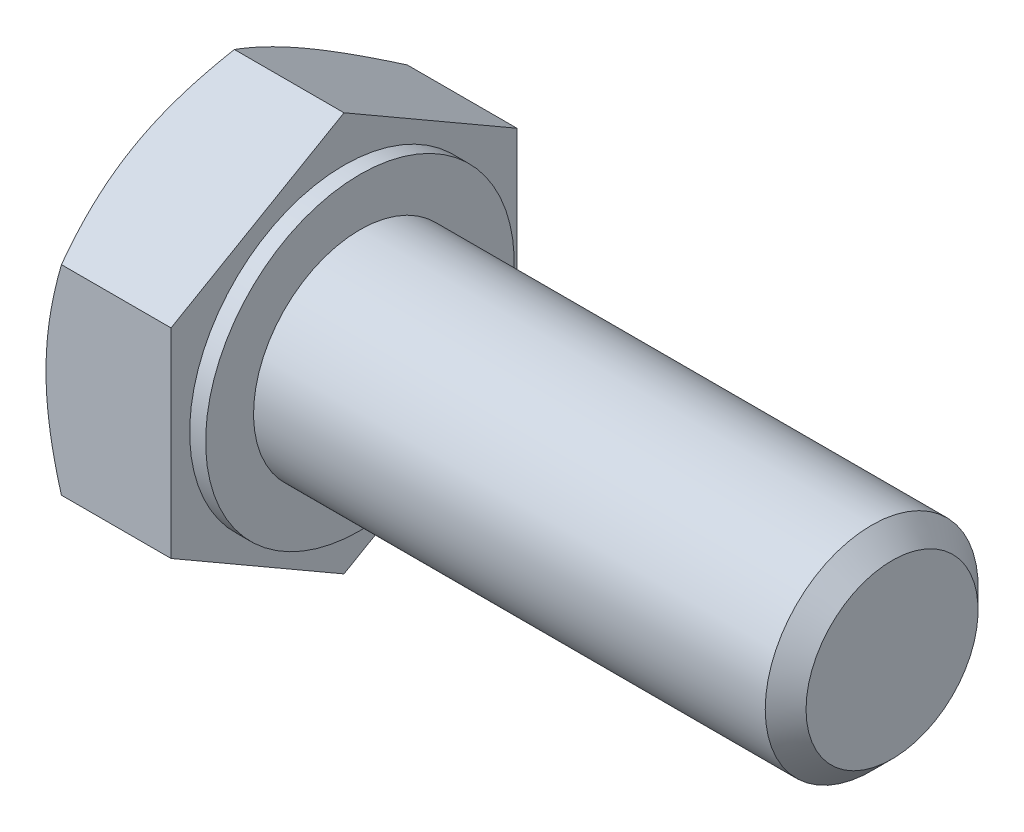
ISO-10303-21;
HEADER;
FILE_DESCRIPTION(('STEP AP214'),'2;1');
FILE_NAME('part.step','',(''),(''),'','','');
FILE_SCHEMA(('AUTOMOTIVE_DESIGN { 1 0 10303 214 1 1 1 1 }'));
ENDSEC;
DATA;
#1=APPLICATION_CONTEXT('core data for automotive mechanical design processes');
#2=APPLICATION_PROTOCOL_DEFINITION('international standard','automotive_design',2000,#1);
#3=PRODUCT_CONTEXT('',#1,'mechanical');
#4=PRODUCT('Part','Part','',(#3));
#5=PRODUCT_RELATED_PRODUCT_CATEGORY('part','',(#4));
#6=PRODUCT_DEFINITION_FORMATION('','',#4);
#7=PRODUCT_DEFINITION_CONTEXT('part definition',#1,'design');
#8=PRODUCT_DEFINITION('design','',#6,#7);
#9=PRODUCT_DEFINITION_SHAPE('','',#8);
#10=(LENGTH_UNIT() NAMED_UNIT(*) SI_UNIT(.MILLI.,.METRE.));
#11=(NAMED_UNIT(*) PLANE_ANGLE_UNIT() SI_UNIT($,.RADIAN.));
#12=(NAMED_UNIT(*) SI_UNIT($,.STERADIAN.) SOLID_ANGLE_UNIT());
#13=UNCERTAINTY_MEASURE_WITH_UNIT(LENGTH_MEASURE(1.E-05),#10,'distance_accuracy_value','');
#14=(GEOMETRIC_REPRESENTATION_CONTEXT(3) GLOBAL_UNCERTAINTY_ASSIGNED_CONTEXT((#13)) GLOBAL_UNIT_ASSIGNED_CONTEXT((#10,
#11,#12)) REPRESENTATION_CONTEXT('',''));
#15=CARTESIAN_POINT('',(0.,0.,0.));
#16=DIRECTION('',(0.,0.,1.));
#17=DIRECTION('',(1.,0.,0.));
#18=AXIS2_PLACEMENT_3D('',#15,#16,#17);
#19=CARTESIAN_POINT('',(-5.30009999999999,0.,0.));
#20=DIRECTION('',(1.,0.,0.));
#21=DIRECTION('',(0.,0.,-1.));
#22=AXIS2_PLACEMENT_3D('',#19,#20,#21);
#23=PLANE('',#22);
#24=CARTESIAN_POINT('',(-5.30010000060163,0.,0.));
#25=DIRECTION('',(1.,0.,0.));
#26=DIRECTION('',(0.,0.,-1.));
#27=AXIS2_PLACEMENT_3D('',#24,#25,#26);
#28=CIRCLE('',#27,6.50000000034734);
#29=CARTESIAN_POINT('',(-5.3001000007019,5.62916512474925,-3.25000000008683));
#30=VERTEX_POINT('',#29);
#31=CARTESIAN_POINT('',(-5.3001000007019,5.62916512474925,3.25000000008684));
#32=VERTEX_POINT('',#31);
#33=EDGE_CURVE('E347',#30,#32,#28,.T.);
#34=ORIENTED_EDGE('',*,*,#33,.F.);
#35=CARTESIAN_POINT('',(-5.30010000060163,0.,0.));
#36=DIRECTION('',(1.,0.,0.));
#37=DIRECTION('',(0.,0.,-1.));
#38=AXIS2_PLACEMENT_3D('',#35,#36,#37);
#39=CIRCLE('',#38,6.50000000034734);
#40=CARTESIAN_POINT('',(-5.3001000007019,0.,-6.50000000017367));
#41=VERTEX_POINT('',#40);
#42=EDGE_CURVE('E343',#41,#30,#39,.T.);
#43=ORIENTED_EDGE('',*,*,#42,.F.);
#44=CARTESIAN_POINT('',(-5.30010000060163,0.,0.));
#45=DIRECTION('',(1.,0.,0.));
#46=DIRECTION('',(0.,0.,-1.));
#47=AXIS2_PLACEMENT_3D('',#44,#45,#46);
#48=CIRCLE('',#47,6.50000000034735);
#49=CARTESIAN_POINT('',(-5.3001000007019,-5.62916512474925,-3.25000000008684));
#50=VERTEX_POINT('',#49);
#51=EDGE_CURVE('E339',#50,#41,#48,.T.);
#52=ORIENTED_EDGE('',*,*,#51,.F.);
#53=CARTESIAN_POINT('',(-5.30010000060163,0.,0.));
#54=DIRECTION('',(1.,0.,0.));
#55=DIRECTION('',(0.,0.,-1.));
#56=AXIS2_PLACEMENT_3D('',#53,#54,#55);
#57=CIRCLE('',#56,6.50000000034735);
#58=CARTESIAN_POINT('',(-5.3001000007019,-5.62916512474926,3.25000000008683));
#59=VERTEX_POINT('',#58);
#60=EDGE_CURVE('E90',#59,#50,#57,.T.);
#61=ORIENTED_EDGE('',*,*,#60,.F.);
#62=CARTESIAN_POINT('',(-5.30010000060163,0.,0.));
#63=DIRECTION('',(1.,0.,0.));
#64=DIRECTION('',(0.,0.,-1.));
#65=AXIS2_PLACEMENT_3D('',#62,#63,#64);
#66=CIRCLE('',#65,6.50000000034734);
#67=CARTESIAN_POINT('',(-5.3001000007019,0.,6.50000000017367));
#68=VERTEX_POINT('',#67);
#69=EDGE_CURVE('E87',#68,#59,#66,.T.);
#70=ORIENTED_EDGE('',*,*,#69,.F.);
#71=CARTESIAN_POINT('',(-5.30010000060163,0.,0.));
#72=DIRECTION('',(1.,0.,0.));
#73=DIRECTION('',(0.,0.,-1.));
#74=AXIS2_PLACEMENT_3D('',#71,#72,#73);
#75=CIRCLE('',#74,6.50000000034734);
#76=EDGE_CURVE('E19',#32,#68,#75,.T.);
#77=ORIENTED_EDGE('',*,*,#76,.F.);
#78=EDGE_LOOP('',(#34,#43,#52,#61,#70,#77));
#79=FACE_BOUND('',#78,.T.);
#80=ADVANCED_FACE('F16',(#79),#23,.F.);
#81=CARTESIAN_POINT('',(-4.71606007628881,0.,0.));
#82=DIRECTION('',(1.,0.,0.));
#83=DIRECTION('',(0.,0.,-1.));
#84=AXIS2_PLACEMENT_3D('',#81,#82,#83);
#85=CONICAL_SURFACE('',#84,7.51158682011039,1.04719755);
#86=ORIENTED_EDGE('',*,*,#76,.T.);
#87=CARTESIAN_POINT('',(-4.71954341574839,3.75277674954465,6.50000000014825));
#88=CARTESIAN_POINT('',(-4.80774841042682,3.44730232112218,6.50000000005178));
#89=CARTESIAN_POINT('',(-4.88855958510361,3.13938154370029,6.50000000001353));
#90=CARTESIAN_POINT('',(-5.03106863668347,2.52082569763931,6.49999999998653));
#91=CARTESIAN_POINT('',(-5.09286102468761,2.2102122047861,6.49999999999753));
#92=CARTESIAN_POINT('',(-5.16873158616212,1.74136052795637,6.50000000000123));
#93=CARTESIAN_POINT('',(-5.19122798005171,1.58448437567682,6.50000000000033));
#94=CARTESIAN_POINT('',(-5.23016970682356,1.26998104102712,6.49999999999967));
#95=CARTESIAN_POINT('',(-5.24661519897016,1.11235387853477,6.4999999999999));
#96=CARTESIAN_POINT('',(-5.27316617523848,0.795765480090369,6.50000000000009));
#97=CARTESIAN_POINT('',(-5.28323941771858,0.636801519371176,6.50000000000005));
#98=CARTESIAN_POINT('',(-5.29672027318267,0.31856096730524,6.49999999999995));
#99=CARTESIAN_POINT('',(-5.30012656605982,0.159284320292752,6.4999999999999));
#100=CARTESIAN_POINT('',(-5.30010000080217,1.44683826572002E-11,6.5));
#101=B_SPLINE_CURVE_WITH_KNOTS('',3,(#87,#88,#89,#90,#91,#92,#93,#94,#95,#96,#97,#98,#99,#100),
.UNSPECIFIED.,.F.,.F.,(4,2,2,2,2,2,4),(0.,0.95424765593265,1.90367376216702,2.37900973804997,
2.85433320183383,3.33204281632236,3.80984701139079),.UNSPECIFIED.);
#102=CARTESIAN_POINT('',(-4.71954341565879,3.75277674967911,6.49999999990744));
#103=VERTEX_POINT('',#102);
#104=EDGE_CURVE('E108',#103,#68,#101,.T.);
#105=ORIENTED_EDGE('',*,*,#104,.F.);
#106=CARTESIAN_POINT('',(-5.30010000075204,5.62916512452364,3.24999999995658));
#107=CARTESIAN_POINT('',(-5.30012656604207,5.54952296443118,3.38794426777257));
#108=CARTESIAN_POINT('',(-5.29672027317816,5.4698846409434,3.52588189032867));
#109=CARTESIAN_POINT('',(-5.28323941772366,5.31076436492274,3.80148629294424));
#110=CARTESIAN_POINT('',(-5.27316617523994,5.231282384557,3.93915312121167));
#111=CARTESIAN_POINT('',(-5.24661519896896,5.07298818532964,4.21332671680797));
#112=CARTESIAN_POINT('',(-5.23016970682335,4.99417460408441,4.34983584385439));
#113=CARTESIAN_POINT('',(-5.19122798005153,4.8369229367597,4.62220372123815));
#114=CARTESIAN_POINT('',(-5.16873158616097,4.75848486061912,4.75806245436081));
#115=CARTESIAN_POINT('',(-5.09286102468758,4.52405902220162,5.16409991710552));
#116=CARTESIAN_POINT('',(-5.03106863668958,4.36875227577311,5.43309909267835));
#117=CARTESIAN_POINT('',(-4.88855958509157,4.059474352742,5.96878416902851));
#118=CARTESIAN_POINT('',(-4.80774841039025,3.90551396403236,6.23545138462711));
#119=CARTESIAN_POINT('',(-4.71954341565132,3.7527767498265,6.49999999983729));
#120=B_SPLINE_CURVE_WITH_KNOTS('',3,(#106,#107,#108,#109,#110,#111,#112,#113,#114,#115,#116,
#117,#118,#119),.UNSPECIFIED.,.F.,.F.,(4,2,2,2,2,2,4),(0.,0.477804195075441,0.955513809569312,
1.43083727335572,1.90617324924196,2.85559935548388,3.80984701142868),.UNSPECIFIED.);
#121=EDGE_CURVE('E102',#32,#103,#120,.T.);
#122=ORIENTED_EDGE('',*,*,#121,.F.);
#123=EDGE_LOOP('',(#86,#105,#122));
#124=FACE_BOUND('',#123,.T.);
#125=ADVANCED_FACE('F107',(#124),#85,.T.);
#126=CARTESIAN_POINT('',(-4.71606007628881,0.,0.));
#127=DIRECTION('',(1.,0.,0.));
#128=DIRECTION('',(0.,0.,-1.));
#129=AXIS2_PLACEMENT_3D('',#126,#127,#128);
#130=CONICAL_SURFACE('',#129,7.51158682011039,1.04719755);
#131=CARTESIAN_POINT('',(-5.30010000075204,0.,6.49999999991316));
#132=CARTESIAN_POINT('',(-5.30012656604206,-0.159284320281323,6.49999999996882));
#133=CARTESIAN_POINT('',(-5.29672027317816,-0.318560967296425,6.49999999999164));
#134=CARTESIAN_POINT('',(-5.28323941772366,-0.636801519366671,6.50000000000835));
#135=CARTESIAN_POINT('',(-5.27316617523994,-0.795765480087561,6.50000000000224));
#136=CARTESIAN_POINT('',(-5.24661519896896,-1.11235387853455,6.49999999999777));
#137=CARTESIAN_POINT('',(-5.23016970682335,-1.26998104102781,6.49999999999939));
#138=CARTESIAN_POINT('',(-5.19122798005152,-1.58448437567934,6.50000000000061));
#139=CARTESIAN_POINT('',(-5.16873158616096,-1.74136052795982,6.50000000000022));
#140=CARTESIAN_POINT('',(-5.09286102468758,-2.21021220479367,6.49999999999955));
#141=CARTESIAN_POINT('',(-5.03106863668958,-2.52082569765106,6.49999999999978));
#142=CARTESIAN_POINT('',(-4.88855958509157,-3.13938154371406,6.50000000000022));
#143=CARTESIAN_POINT('',(-4.80774841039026,-3.44730232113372,6.50000000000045));
#144=CARTESIAN_POINT('',(-4.71954341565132,-3.75277674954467,6.5));
#145=B_SPLINE_CURVE_WITH_KNOTS('',3,(#131,#132,#133,#134,#135,#136,#137,#138,#139,#140,#141,
#142,#143,#144),.UNSPECIFIED.,.F.,.F.,(4,2,2,2,2,2,4),(0.,0.477804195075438,0.955513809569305,
1.43083727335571,1.90617324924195,2.85559935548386,3.80984701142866),.UNSPECIFIED.);
#146=CARTESIAN_POINT('',(-4.71954341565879,-3.75277674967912,6.49999999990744));
#147=VERTEX_POINT('',#146);
#148=EDGE_CURVE('E95',#68,#147,#145,.T.);
#149=ORIENTED_EDGE('',*,*,#148,.F.);
#150=ORIENTED_EDGE('',*,*,#69,.T.);
#151=CARTESIAN_POINT('',(-4.71954341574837,-3.75277674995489,6.49999999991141));
#152=CARTESIAN_POINT('',(-4.80774841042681,-3.90551396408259,6.23545138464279));
#153=CARTESIAN_POINT('',(-4.8885595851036,-4.05947435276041,5.96878416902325));
#154=CARTESIAN_POINT('',(-5.03106863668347,-4.36875227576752,5.43309909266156));
#155=CARTESIAN_POINT('',(-5.09286102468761,-4.52405902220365,5.16409991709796));
#156=CARTESIAN_POINT('',(-5.16873158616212,-4.75848486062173,4.75806245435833));
#157=CARTESIAN_POINT('',(-5.19122798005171,-4.83692293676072,4.62220372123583));
#158=CARTESIAN_POINT('',(-5.23016970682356,-4.99417460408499,4.34983584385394));
#159=CARTESIAN_POINT('',(-5.24661519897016,-5.07298818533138,4.21332671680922));
#160=CARTESIAN_POINT('',(-5.27316617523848,-5.23128238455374,3.93915312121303));
#161=CARTESIAN_POINT('',(-5.28323941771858,-5.3107643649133,3.80148629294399));
#162=CARTESIAN_POINT('',(-5.29672027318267,-5.46988464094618,3.52588189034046));
#163=CARTESIAN_POINT('',(-5.30012656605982,-5.54952296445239,3.38794426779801));
#164=CARTESIAN_POINT('',(-5.30010000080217,-5.62916512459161,3.25000000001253));
#165=B_SPLINE_CURVE_WITH_KNOTS('',3,(#151,#152,#153,#154,#155,#156,#157,#158,#159,#160,#161,
#162,#163,#164),.UNSPECIFIED.,.F.,.F.,(4,2,2,2,2,2,4),(0.,0.954247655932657,1.90367376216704,
2.37900973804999,2.85433320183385,3.33204281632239,3.80984701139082),.UNSPECIFIED.);
#166=EDGE_CURVE('E97',#147,#59,#165,.T.);
#167=ORIENTED_EDGE('',*,*,#166,.F.);
#168=EDGE_LOOP('',(#149,#150,#167));
#169=FACE_BOUND('',#168,.T.);
#170=ADVANCED_FACE('F96',(#169),#130,.T.);
#171=CARTESIAN_POINT('',(-4.71606007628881,0.,0.));
#172=DIRECTION('',(1.,0.,0.));
#173=DIRECTION('',(0.,0.,-1.));
#174=AXIS2_PLACEMENT_3D('',#171,#172,#173);
#175=CONICAL_SURFACE('',#174,7.51158682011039,1.04719755);
#176=CARTESIAN_POINT('',(-5.30010000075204,-5.62916512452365,3.24999999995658));
#177=CARTESIAN_POINT('',(-5.30012656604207,-5.7088072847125,3.11205573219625));
#178=CARTESIAN_POINT('',(-5.29672027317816,-5.78844560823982,2.97411810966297));
#179=CARTESIAN_POINT('',(-5.28323941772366,-5.94756588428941,2.69851370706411));
#180=CARTESIAN_POINT('',(-5.27316617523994,-6.02704786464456,2.56084687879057));
#181=CARTESIAN_POINT('',(-5.24661519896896,-6.18534206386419,2.28667328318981));
#182=CARTESIAN_POINT('',(-5.23016970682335,-6.26415564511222,2.150164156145));
#183=CARTESIAN_POINT('',(-5.19122798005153,-6.42140731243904,1.87779627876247));
#184=CARTESIAN_POINT('',(-5.16873158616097,-6.49984538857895,1.74193754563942));
#185=CARTESIAN_POINT('',(-5.09286102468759,-6.7342712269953,1.33590008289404));
#186=CARTESIAN_POINT('',(-5.03106863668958,-6.88957797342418,1.06690090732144));
#187=CARTESIAN_POINT('',(-4.88855958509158,-7.19885589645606,0.531215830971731));
#188=CARTESIAN_POINT('',(-4.80774841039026,-7.35281628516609,0.264548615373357));
#189=CARTESIAN_POINT('',(-4.71954341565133,-7.50555349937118,1.6272616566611E-10));
#190=B_SPLINE_CURVE_WITH_KNOTS('',3,(#176,#177,#178,#179,#180,#181,#182,#183,#184,#185,#186,
#187,#188,#189),.UNSPECIFIED.,.F.,.F.,(4,2,2,2,2,2,4),(0.,0.477804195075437,0.955513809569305,
1.43083727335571,1.90617324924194,2.85559935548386,3.80984701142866),.UNSPECIFIED.);
#191=CARTESIAN_POINT('',(-4.71954341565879,-7.50555349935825,0.));
#192=VERTEX_POINT('',#191);
#193=EDGE_CURVE('E113',#59,#192,#190,.T.);
#194=ORIENTED_EDGE('',*,*,#193,.F.);
#195=ORIENTED_EDGE('',*,*,#60,.T.);
#196=CARTESIAN_POINT('',(-4.71954341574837,-7.50555349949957,-2.36832132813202E-10));
#197=CARTESIAN_POINT('',(-4.80774841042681,-7.3528162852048,-0.264548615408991));
#198=CARTESIAN_POINT('',(-4.8885595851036,-7.19885589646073,-0.531215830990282));
#199=CARTESIAN_POINT('',(-5.03106863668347,-6.88957797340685,-1.06690090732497));
#200=CARTESIAN_POINT('',(-5.09286102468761,-6.73427122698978,-1.33590008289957));
#201=CARTESIAN_POINT('',(-5.16873158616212,-6.49984538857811,-1.7419375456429));
#202=CARTESIAN_POINT('',(-5.19122798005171,-6.42140731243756,-1.8777962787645));
#203=CARTESIAN_POINT('',(-5.23016970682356,-6.26415564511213,-2.15016415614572));
#204=CARTESIAN_POINT('',(-5.24661519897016,-6.18534206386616,-2.28667328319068));
#205=CARTESIAN_POINT('',(-5.27316617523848,-6.02704786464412,-2.56084687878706));
#206=CARTESIAN_POINT('',(-5.28323941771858,-5.94756588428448,-2.69851370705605));
#207=CARTESIAN_POINT('',(-5.29672027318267,-5.78844560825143,-2.97411810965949));
#208=CARTESIAN_POINT('',(-5.30012656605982,-5.70880728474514,-3.11205573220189));
#209=CARTESIAN_POINT('',(-5.30010000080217,-5.62916512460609,-3.24999999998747));
#210=B_SPLINE_CURVE_WITH_KNOTS('',3,(#196,#197,#198,#199,#200,#201,#202,#203,#204,#205,#206,
#207,#208,#209),.UNSPECIFIED.,.F.,.F.,(4,2,2,2,2,2,4),(0.,0.954247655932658,1.90367376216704,
2.37900973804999,2.85433320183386,3.33204281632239,3.80984701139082),.UNSPECIFIED.);
#211=EDGE_CURVE('E207',#192,#50,#210,.T.);
#212=ORIENTED_EDGE('',*,*,#211,.F.);
#213=EDGE_LOOP('',(#194,#195,#212));
#214=FACE_BOUND('',#213,.T.);
#215=ADVANCED_FACE('F215',(#214),#175,.T.);
#216=CARTESIAN_POINT('',(-4.71606007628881,0.,0.));
#217=DIRECTION('',(1.,0.,0.));
#218=DIRECTION('',(0.,0.,-1.));
#219=AXIS2_PLACEMENT_3D('',#216,#217,#218);
#220=CONICAL_SURFACE('',#219,7.51158682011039,1.04719755);
#221=CARTESIAN_POINT('',(-5.30010000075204,-5.62916512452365,-3.24999999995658));
#222=CARTESIAN_POINT('',(-5.30012656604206,-5.54952296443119,-3.38794426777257));
#223=CARTESIAN_POINT('',(-5.29672027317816,-5.46988464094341,-3.52588189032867));
#224=CARTESIAN_POINT('',(-5.28323941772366,-5.31076436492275,-3.80148629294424));
#225=CARTESIAN_POINT('',(-5.27316617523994,-5.23128238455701,-3.93915312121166));
#226=CARTESIAN_POINT('',(-5.24661519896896,-5.07298818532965,-4.21332671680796));
#227=CARTESIAN_POINT('',(-5.23016970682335,-4.99417460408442,-4.34983584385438));
#228=CARTESIAN_POINT('',(-5.19122798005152,-4.83692293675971,-4.62220372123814));
#229=CARTESIAN_POINT('',(-5.16873158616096,-4.75848486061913,-4.7580624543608));
#230=CARTESIAN_POINT('',(-5.09286102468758,-4.52405902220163,-5.16409991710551));
#231=CARTESIAN_POINT('',(-5.03106863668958,-4.36875227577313,-5.43309909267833));
#232=CARTESIAN_POINT('',(-4.88855958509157,-4.05947435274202,-5.96878416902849));
#233=CARTESIAN_POINT('',(-4.80774841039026,-3.90551396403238,-6.23545138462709));
#234=CARTESIAN_POINT('',(-4.71954341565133,-3.75277674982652,-6.49999999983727));
#235=B_SPLINE_CURVE_WITH_KNOTS('',3,(#221,#222,#223,#224,#225,#226,#227,#228,#229,#230,#231,
#232,#233,#234),.UNSPECIFIED.,.F.,.F.,(4,2,2,2,2,2,4),(0.,0.477804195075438,0.955513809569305,
1.43083727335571,1.90617324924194,2.85559935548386,3.80984701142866),.UNSPECIFIED.);
#236=CARTESIAN_POINT('',(-4.71954341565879,-3.75277674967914,-6.49999999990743));
#237=VERTEX_POINT('',#236);
#238=EDGE_CURVE('E219',#50,#237,#235,.T.);
#239=ORIENTED_EDGE('',*,*,#238,.F.);
#240=ORIENTED_EDGE('',*,*,#51,.T.);
#241=CARTESIAN_POINT('',(-4.71954341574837,-3.75277674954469,-6.50000000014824));
#242=CARTESIAN_POINT('',(-4.8077484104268,-3.44730232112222,-6.50000000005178));
#243=CARTESIAN_POINT('',(-4.8885595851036,-3.13938154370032,-6.50000000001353));
#244=CARTESIAN_POINT('',(-5.03106863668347,-2.52082569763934,-6.49999999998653));
#245=CARTESIAN_POINT('',(-5.09286102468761,-2.21021220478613,-6.49999999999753));
#246=CARTESIAN_POINT('',(-5.16873158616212,-1.74136052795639,-6.50000000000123));
#247=CARTESIAN_POINT('',(-5.19122798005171,-1.58448437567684,-6.50000000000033));
#248=CARTESIAN_POINT('',(-5.23016970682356,-1.26998104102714,-6.49999999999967));
#249=CARTESIAN_POINT('',(-5.24661519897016,-1.11235387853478,-6.4999999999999));
#250=CARTESIAN_POINT('',(-5.27316617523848,-0.795765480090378,-6.50000000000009));
#251=CARTESIAN_POINT('',(-5.28323941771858,-0.636801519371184,-6.50000000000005));
#252=CARTESIAN_POINT('',(-5.29672027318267,-0.318560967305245,-6.49999999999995));
#253=CARTESIAN_POINT('',(-5.30012656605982,-0.159284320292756,-6.4999999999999));
#254=CARTESIAN_POINT('',(-5.30010000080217,-1.4470694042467E-11,-6.5));
#255=B_SPLINE_CURVE_WITH_KNOTS('',3,(#241,#242,#243,#244,#245,#246,#247,#248,#249,#250,#251,
#252,#253,#254),.UNSPECIFIED.,.F.,.F.,(4,2,2,2,2,2,4),(0.,0.954247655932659,1.90367376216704,
2.37900973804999,2.85433320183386,3.3320428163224,3.80984701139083),.UNSPECIFIED.);
#256=EDGE_CURVE('E201',#237,#41,#255,.T.);
#257=ORIENTED_EDGE('',*,*,#256,.F.);
#258=EDGE_LOOP('',(#239,#240,#257));
#259=FACE_BOUND('',#258,.T.);
#260=ADVANCED_FACE('F212',(#259),#220,.T.);
#261=CARTESIAN_POINT('',(-4.71606007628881,0.,0.));
#262=DIRECTION('',(1.,0.,0.));
#263=DIRECTION('',(0.,0.,-1.));
#264=AXIS2_PLACEMENT_3D('',#261,#262,#263);
#265=CONICAL_SURFACE('',#264,7.51158682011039,1.04719755);
#266=ORIENTED_EDGE('',*,*,#42,.T.);
#267=CARTESIAN_POINT('',(-4.71954341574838,3.75277674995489,-6.49999999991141));
#268=CARTESIAN_POINT('',(-4.80774841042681,3.90551396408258,-6.23545138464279));
#269=CARTESIAN_POINT('',(-4.8885595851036,4.05947435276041,-5.96878416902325));
#270=CARTESIAN_POINT('',(-5.03106863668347,4.36875227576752,-5.43309909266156));
#271=CARTESIAN_POINT('',(-5.09286102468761,4.52405902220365,-5.16409991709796));
#272=CARTESIAN_POINT('',(-5.16873158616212,4.75848486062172,-4.75806245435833));
#273=CARTESIAN_POINT('',(-5.19122798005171,4.83692293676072,-4.62220372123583));
#274=CARTESIAN_POINT('',(-5.23016970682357,4.99417460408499,-4.34983584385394));
#275=CARTESIAN_POINT('',(-5.24661519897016,5.07298818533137,-4.21332671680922));
#276=CARTESIAN_POINT('',(-5.27316617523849,5.23128238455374,-3.93915312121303));
#277=CARTESIAN_POINT('',(-5.28323941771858,5.3107643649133,-3.80148629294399));
#278=CARTESIAN_POINT('',(-5.29672027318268,5.46988464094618,-3.52588189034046));
#279=CARTESIAN_POINT('',(-5.30012656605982,5.54952296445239,-3.38794426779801));
#280=CARTESIAN_POINT('',(-5.30010000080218,5.62916512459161,-3.25000000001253));
#281=B_SPLINE_CURVE_WITH_KNOTS('',3,(#267,#268,#269,#270,#271,#272,#273,#274,#275,#276,#277,
#278,#279,#280),.UNSPECIFIED.,.F.,.F.,(4,2,2,2,2,2,4),(0.,0.954247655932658,1.90367376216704,
2.37900973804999,2.85433320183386,3.3320428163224,3.80984701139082),.UNSPECIFIED.);
#282=CARTESIAN_POINT('',(-4.71954341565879,3.75277674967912,-6.49999999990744));
#283=VERTEX_POINT('',#282);
#284=EDGE_CURVE('E173',#283,#30,#281,.T.);
#285=ORIENTED_EDGE('',*,*,#284,.F.);
#286=CARTESIAN_POINT('',(-5.30010000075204,0.,-6.49999999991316));
#287=CARTESIAN_POINT('',(-5.30012656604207,0.15928432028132,-6.49999999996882));
#288=CARTESIAN_POINT('',(-5.29672027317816,0.318560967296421,-6.49999999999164));
#289=CARTESIAN_POINT('',(-5.28323941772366,0.636801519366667,-6.50000000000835));
#290=CARTESIAN_POINT('',(-5.27316617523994,0.795765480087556,-6.50000000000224));
#291=CARTESIAN_POINT('',(-5.24661519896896,1.11235387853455,-6.49999999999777));
#292=CARTESIAN_POINT('',(-5.23016970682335,1.26998104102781,-6.49999999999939));
#293=CARTESIAN_POINT('',(-5.19122798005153,1.58448437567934,-6.50000000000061));
#294=CARTESIAN_POINT('',(-5.16873158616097,1.74136052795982,-6.50000000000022));
#295=CARTESIAN_POINT('',(-5.09286102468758,2.21021220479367,-6.49999999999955));
#296=CARTESIAN_POINT('',(-5.03106863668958,2.52082569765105,-6.49999999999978));
#297=CARTESIAN_POINT('',(-4.88855958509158,3.13938154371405,-6.50000000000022));
#298=CARTESIAN_POINT('',(-4.80774841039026,3.44730232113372,-6.50000000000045));
#299=CARTESIAN_POINT('',(-4.71954341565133,3.75277674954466,-6.5));
#300=B_SPLINE_CURVE_WITH_KNOTS('',3,(#286,#287,#288,#289,#290,#291,#292,#293,#294,#295,#296,
#297,#298,#299),.UNSPECIFIED.,.F.,.F.,(4,2,2,2,2,2,4),(0.,0.477804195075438,0.955513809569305,
1.43083727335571,1.90617324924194,2.85559935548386,3.80984701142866),.UNSPECIFIED.);
#301=EDGE_CURVE('E196',#41,#283,#300,.T.);
#302=ORIENTED_EDGE('',*,*,#301,.F.);
#303=EDGE_LOOP('',(#266,#285,#302));
#304=FACE_BOUND('',#303,.T.);
#305=ADVANCED_FACE('F158',(#304),#265,.T.);
#306=CARTESIAN_POINT('',(-4.71606007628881,0.,0.));
#307=DIRECTION('',(1.,0.,0.));
#308=DIRECTION('',(0.,0.,-1.));
#309=AXIS2_PLACEMENT_3D('',#306,#307,#308);
#310=CONICAL_SURFACE('',#309,7.51158682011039,1.04719755);
#311=ORIENTED_EDGE('',*,*,#33,.T.);
#312=CARTESIAN_POINT('',(-4.71954341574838,7.50555349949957,2.36845423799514E-10));
#313=CARTESIAN_POINT('',(-4.80774841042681,7.3528162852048,0.264548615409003));
#314=CARTESIAN_POINT('',(-4.8885595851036,7.19885589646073,0.531215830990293));
#315=CARTESIAN_POINT('',(-5.03106863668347,6.88957797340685,1.06690090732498));
#316=CARTESIAN_POINT('',(-5.09286102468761,6.73427122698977,1.33590008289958));
#317=CARTESIAN_POINT('',(-5.16873158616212,6.49984538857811,1.74193754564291));
#318=CARTESIAN_POINT('',(-5.19122798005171,6.42140731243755,1.8777962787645));
#319=CARTESIAN_POINT('',(-5.23016970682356,6.26415564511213,2.15016415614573));
#320=CARTESIAN_POINT('',(-5.24661519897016,6.18534206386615,2.28667328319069));
#321=CARTESIAN_POINT('',(-5.27316617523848,6.02704786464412,2.56084687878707));
#322=CARTESIAN_POINT('',(-5.28323941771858,5.94756588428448,2.69851370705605));
#323=CARTESIAN_POINT('',(-5.29672027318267,5.78844560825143,2.97411810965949));
#324=CARTESIAN_POINT('',(-5.30012656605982,5.70880728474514,3.11205573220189));
#325=CARTESIAN_POINT('',(-5.30010000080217,5.62916512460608,3.24999999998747));
#326=B_SPLINE_CURVE_WITH_KNOTS('',3,(#312,#313,#314,#315,#316,#317,#318,#319,#320,#321,#322,
#323,#324,#325),.UNSPECIFIED.,.F.,.F.,(4,2,2,2,2,2,4),(0.,0.954247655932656,1.90367376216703,
2.37900973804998,2.85433320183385,3.33204281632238,3.80984701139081),.UNSPECIFIED.);
#327=CARTESIAN_POINT('',(-4.71954341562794,7.50555349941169,9.25589075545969E-11));
#328=VERTEX_POINT('',#327);
#329=EDGE_CURVE('E143',#328,#32,#326,.T.);
#330=ORIENTED_EDGE('',*,*,#329,.F.);
#331=CARTESIAN_POINT('',(-5.30010000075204,5.62916512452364,-3.24999999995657));
#332=CARTESIAN_POINT('',(-5.30012656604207,5.7088072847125,-3.11205573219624));
#333=CARTESIAN_POINT('',(-5.29672027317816,5.78844560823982,-2.97411810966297));
#334=CARTESIAN_POINT('',(-5.28323941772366,5.94756588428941,-2.69851370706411));
#335=CARTESIAN_POINT('',(-5.27316617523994,6.02704786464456,-2.56084687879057));
#336=CARTESIAN_POINT('',(-5.24661519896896,6.1853420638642,-2.28667328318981));
#337=CARTESIAN_POINT('',(-5.23016970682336,6.26415564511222,-2.150164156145));
#338=CARTESIAN_POINT('',(-5.19122798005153,6.42140731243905,-1.87779627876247));
#339=CARTESIAN_POINT('',(-5.16873158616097,6.49984538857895,-1.74193754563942));
#340=CARTESIAN_POINT('',(-5.09286102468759,6.7342712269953,-1.33590008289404));
#341=CARTESIAN_POINT('',(-5.03106863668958,6.88957797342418,-1.06690090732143));
#342=CARTESIAN_POINT('',(-4.88855958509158,7.19885589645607,-0.531215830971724));
#343=CARTESIAN_POINT('',(-4.80774841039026,7.3528162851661,-0.264548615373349));
#344=CARTESIAN_POINT('',(-4.71954341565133,7.50555349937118,-1.62717065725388E-10));
#345=B_SPLINE_CURVE_WITH_KNOTS('',3,(#331,#332,#333,#334,#335,#336,#337,#338,#339,#340,#341,
#342,#343,#344),.UNSPECIFIED.,.F.,.F.,(4,2,2,2,2,2,4),(0.,0.477804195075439,0.955513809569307,
1.43083727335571,1.90617324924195,2.85559935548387,3.80984701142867),.UNSPECIFIED.);
#346=EDGE_CURVE('E164',#30,#328,#345,.T.);
#347=ORIENTED_EDGE('',*,*,#346,.F.);
#348=EDGE_LOOP('',(#311,#330,#347));
#349=FACE_BOUND('',#348,.T.);
#350=ADVANCED_FACE('F152',(#349),#310,.T.);
#351=CARTESIAN_POINT('',(-0.600099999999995,7.50555349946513,0.));
#352=DIRECTION('',(0.,0.866025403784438,0.500000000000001));
#353=DIRECTION('',(0.,-0.500000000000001,0.866025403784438));
#354=AXIS2_PLACEMENT_3D('',#351,#352,#353);
#355=PLANE('',#354);
#356=DIRECTION('',(0.,-0.500000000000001,0.866025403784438));
#357=VECTOR('',#356,1.);
#358=CARTESIAN_POINT('',(-0.600099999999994,7.50555349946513,0.));
#359=LINE('',#358,#357);
#360=CARTESIAN_POINT('',(-0.600099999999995,7.50555349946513,0.));
#361=VERTEX_POINT('',#360);
#362=CARTESIAN_POINT('',(-0.600099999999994,3.75277674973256,6.5));
#363=VERTEX_POINT('',#362);
#364=EDGE_CURVE('E286',#361,#363,#359,.T.);
#365=ORIENTED_EDGE('',*,*,#364,.F.);
#366=DIRECTION('',(1.,0.,0.));
#367=VECTOR('',#366,1.);
#368=CARTESIAN_POINT('',(-0.600099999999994,7.50555349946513,0.));
#369=LINE('',#368,#367);
#370=EDGE_CURVE('E172',#328,#361,#369,.T.);
#371=ORIENTED_EDGE('',*,*,#370,.F.);
#372=ORIENTED_EDGE('',*,*,#329,.T.);
#373=ORIENTED_EDGE('',*,*,#121,.T.);
#374=DIRECTION('',(1.,0.,0.));
#375=VECTOR('',#374,1.);
#376=CARTESIAN_POINT('',(-0.600099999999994,3.75277674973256,6.5));
#377=LINE('',#376,#375);
#378=EDGE_CURVE('E101',#363,#103,#377,.F.);
#379=ORIENTED_EDGE('',*,*,#378,.F.);
#380=EDGE_LOOP('',(#365,#371,#372,#373,#379));
#381=FACE_BOUND('',#380,.T.);
#382=ADVANCED_FACE('F149',(#381),#355,.T.);
#383=CARTESIAN_POINT('',(-0.600099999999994,3.75277674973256,6.5));
#384=DIRECTION('',(0.,0.,1.));
#385=DIRECTION('',(1.,0.,0.));
#386=AXIS2_PLACEMENT_3D('',#383,#384,#385);
#387=PLANE('',#386);
#388=ORIENTED_EDGE('',*,*,#378,.T.);
#389=ORIENTED_EDGE('',*,*,#104,.T.);
#390=ORIENTED_EDGE('',*,*,#148,.T.);
#391=DIRECTION('',(1.,0.,0.));
#392=VECTOR('',#391,1.);
#393=CARTESIAN_POINT('',(-0.600099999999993,-3.75277674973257,6.49999999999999));
#394=LINE('',#393,#392);
#395=CARTESIAN_POINT('',(-0.600099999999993,-3.75277674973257,6.5));
#396=VERTEX_POINT('',#395);
#397=EDGE_CURVE('E115',#396,#147,#394,.F.);
#398=ORIENTED_EDGE('',*,*,#397,.F.);
#399=DIRECTION('',(0.,1.,0.));
#400=VECTOR('',#399,1.);
#401=CARTESIAN_POINT('',(-0.600099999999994,0.,6.5));
#402=LINE('',#401,#400);
#403=EDGE_CURVE('E282',#363,#396,#402,.F.);
#404=ORIENTED_EDGE('',*,*,#403,.F.);
#405=EDGE_LOOP('',(#388,#389,#390,#398,#404));
#406=FACE_BOUND('',#405,.T.);
#407=ADVANCED_FACE('F111',(#406),#387,.T.);
#408=CARTESIAN_POINT('',(-0.600099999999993,-3.75277674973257,6.49999999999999));
#409=DIRECTION('',(0.,-0.866025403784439,0.499999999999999));
#410=DIRECTION('',(0.,-0.499999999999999,-0.866025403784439));
#411=AXIS2_PLACEMENT_3D('',#408,#409,#410);
#412=PLANE('',#411);
#413=ORIENTED_EDGE('',*,*,#397,.T.);
#414=ORIENTED_EDGE('',*,*,#166,.T.);
#415=ORIENTED_EDGE('',*,*,#193,.T.);
#416=DIRECTION('',(1.,0.,0.));
#417=VECTOR('',#416,1.);
#418=CARTESIAN_POINT('',(-0.600099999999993,-7.50555349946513,0.));
#419=LINE('',#418,#417);
#420=CARTESIAN_POINT('',(-0.600099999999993,-7.50555349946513,0.));
#421=VERTEX_POINT('',#420);
#422=EDGE_CURVE('E224',#421,#192,#419,.F.);
#423=ORIENTED_EDGE('',*,*,#422,.F.);
#424=DIRECTION('',(0.,-0.499999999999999,-0.866025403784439));
#425=VECTOR('',#424,1.);
#426=CARTESIAN_POINT('',(-0.600099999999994,-3.75277674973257,6.49999999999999));
#427=LINE('',#426,#425);
#428=EDGE_CURVE('E285',#396,#421,#427,.T.);
#429=ORIENTED_EDGE('',*,*,#428,.F.);
#430=EDGE_LOOP('',(#413,#414,#415,#423,#429));
#431=FACE_BOUND('',#430,.T.);
#432=ADVANCED_FACE('F228',(#431),#412,.T.);
#433=CARTESIAN_POINT('',(-0.600099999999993,-7.50555349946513,0.));
#434=DIRECTION('',(0.,-0.866025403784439,-0.5));
#435=DIRECTION('',(0.,0.5,-0.866025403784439));
#436=AXIS2_PLACEMENT_3D('',#433,#434,#435);
#437=PLANE('',#436);
#438=ORIENTED_EDGE('',*,*,#422,.T.);
#439=ORIENTED_EDGE('',*,*,#211,.T.);
#440=ORIENTED_EDGE('',*,*,#238,.T.);
#441=DIRECTION('',(-1.,0.,0.));
#442=VECTOR('',#441,1.);
#443=CARTESIAN_POINT('',(-0.600099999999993,-3.75277674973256,-6.5));
#444=LINE('',#443,#442);
#445=CARTESIAN_POINT('',(-0.600099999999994,-3.75277674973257,-6.5));
#446=VERTEX_POINT('',#445);
#447=EDGE_CURVE('E320',#446,#237,#444,.T.);
#448=ORIENTED_EDGE('',*,*,#447,.F.);
#449=DIRECTION('',(0.,0.5,-0.866025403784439));
#450=VECTOR('',#449,1.);
#451=CARTESIAN_POINT('',(-0.600099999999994,-7.50555349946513,0.));
#452=LINE('',#451,#450);
#453=EDGE_CURVE('E291',#421,#446,#452,.T.);
#454=ORIENTED_EDGE('',*,*,#453,.F.);
#455=EDGE_LOOP('',(#438,#439,#440,#448,#454));
#456=FACE_BOUND('',#455,.T.);
#457=ADVANCED_FACE('F193',(#456),#437,.T.);
#458=CARTESIAN_POINT('',(-0.600099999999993,-3.75277674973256,-6.5));
#459=DIRECTION('',(0.,0.,-1.));
#460=DIRECTION('',(-1.,0.,0.));
#461=AXIS2_PLACEMENT_3D('',#458,#459,#460);
#462=PLANE('',#461);
#463=DIRECTION('',(0.,1.,0.));
#464=VECTOR('',#463,1.);
#465=CARTESIAN_POINT('',(-0.600099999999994,0.,-6.5));
#466=LINE('',#465,#464);
#467=CARTESIAN_POINT('',(-0.600099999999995,3.75277674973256,-6.49999999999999));
#468=VERTEX_POINT('',#467);
#469=EDGE_CURVE('E296',#446,#468,#466,.T.);
#470=ORIENTED_EDGE('',*,*,#469,.F.);
#471=ORIENTED_EDGE('',*,*,#447,.T.);
#472=ORIENTED_EDGE('',*,*,#256,.T.);
#473=ORIENTED_EDGE('',*,*,#301,.T.);
#474=DIRECTION('',(1.,0.,0.));
#475=VECTOR('',#474,1.);
#476=CARTESIAN_POINT('',(-0.600099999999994,3.75277674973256,-6.49999999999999));
#477=LINE('',#476,#475);
#478=EDGE_CURVE('E34',#468,#283,#477,.F.);
#479=ORIENTED_EDGE('',*,*,#478,.F.);
#480=EDGE_LOOP('',(#470,#471,#472,#473,#479));
#481=FACE_BOUND('',#480,.T.);
#482=ADVANCED_FACE('F186',(#481),#462,.T.);
#483=CARTESIAN_POINT('',(-0.600099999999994,3.75277674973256,-6.49999999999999));
#484=DIRECTION('',(0.,0.866025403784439,-0.5));
#485=DIRECTION('',(0.,0.5,0.866025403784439));
#486=AXIS2_PLACEMENT_3D('',#483,#484,#485);
#487=PLANE('',#486);
#488=DIRECTION('',(0.,0.5,0.866025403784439));
#489=VECTOR('',#488,1.);
#490=CARTESIAN_POINT('',(-0.600099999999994,3.75277674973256,-6.49999999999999));
#491=LINE('',#490,#489);
#492=EDGE_CURVE('E276',#468,#361,#491,.T.);
#493=ORIENTED_EDGE('',*,*,#492,.F.);
#494=ORIENTED_EDGE('',*,*,#478,.T.);
#495=ORIENTED_EDGE('',*,*,#284,.T.);
#496=ORIENTED_EDGE('',*,*,#346,.T.);
#497=ORIENTED_EDGE('',*,*,#370,.T.);
#498=EDGE_LOOP('',(#493,#494,#495,#496,#497));
#499=FACE_BOUND('',#498,.T.);
#500=ADVANCED_FACE('F180',(#499),#487,.T.);
#501=CARTESIAN_POINT('',(-0.600099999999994,0.,0.));
#502=DIRECTION('',(1.,0.,0.));
#503=DIRECTION('',(0.,0.,-1.));
#504=AXIS2_PLACEMENT_3D('',#501,#502,#503);
#505=PLANE('',#504);
#506=CARTESIAN_POINT('',(-0.600099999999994,0.,0.));
#507=DIRECTION('',(1.,0.,0.));
#508=DIRECTION('',(0.,1.,0.));
#509=AXIS2_PLACEMENT_3D('',#506,#507,#508);
#510=CIRCLE('',#509,5.8);
#511=CARTESIAN_POINT('',(-0.600099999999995,5.8,0.));
#512=VERTEX_POINT('',#511);
#513=EDGE_CURVE('E174',#512,#512,#510,.T.);
#514=ORIENTED_EDGE('',*,*,#513,.F.);
#515=EDGE_LOOP('',(#514));
#516=FACE_BOUND('',#515,.T.);
#517=ORIENTED_EDGE('',*,*,#469,.T.);
#518=ORIENTED_EDGE('',*,*,#492,.T.);
#519=ORIENTED_EDGE('',*,*,#364,.T.);
#520=ORIENTED_EDGE('',*,*,#403,.T.);
#521=ORIENTED_EDGE('',*,*,#428,.T.);
#522=ORIENTED_EDGE('',*,*,#453,.T.);
#523=EDGE_LOOP('',(#517,#518,#519,#520,#521,#522));
#524=FACE_BOUND('',#523,.T.);
#525=ADVANCED_FACE('F185',(#516,#524),#505,.T.);
#526=CARTESIAN_POINT('',(-0.300049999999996,0.,0.));
#527=DIRECTION('',(1.,0.,0.));
#528=DIRECTION('',(0.,1.,0.));
#529=AXIS2_PLACEMENT_3D('',#526,#527,#528);
#530=CYLINDRICAL_SURFACE('',#529,5.8);
#531=ORIENTED_EDGE('',*,*,#513,.T.);
#532=EDGE_LOOP('',(#531));
#533=FACE_BOUND('',#532,.T.);
#534=CARTESIAN_POINT('',(0.,0.,0.));
#535=DIRECTION('',(1.,0.,0.));
#536=DIRECTION('',(0.,1.,0.));
#537=AXIS2_PLACEMENT_3D('',#534,#535,#536);
#538=CIRCLE('',#537,5.8);
#539=CARTESIAN_POINT('',(0.,5.8,0.));
#540=VERTEX_POINT('',#539);
#541=EDGE_CURVE('E271',#540,#540,#538,.T.);
#542=ORIENTED_EDGE('',*,*,#541,.F.);
#543=EDGE_LOOP('',(#542));
#544=FACE_BOUND('',#543,.T.);
#545=ADVANCED_FACE('F258',(#533,#544),#530,.T.);
#546=CARTESIAN_POINT('',(20.,2.,0.));
#547=DIRECTION('',(1.,0.,0.));
#548=DIRECTION('',(0.,0.,-1.));
#549=AXIS2_PLACEMENT_3D('',#546,#547,#548);
#550=PLANE('',#549);
#551=CARTESIAN_POINT('',(20.0000000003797,0.,0.));
#552=DIRECTION('',(-1.,0.,0.));
#553=DIRECTION('',(0.,0.,1.));
#554=AXIS2_PLACEMENT_3D('',#551,#552,#553);
#555=CIRCLE('',#554,3.23318750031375);
#556=CARTESIAN_POINT('',(20.0000000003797,0.,3.23318750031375));
#557=VERTEX_POINT('',#556);
#558=EDGE_CURVE('E273',#557,#557,#555,.T.);
#559=ORIENTED_EDGE('',*,*,#558,.F.);
#560=EDGE_LOOP('',(#559));
#561=FACE_BOUND('',#560,.T.);
#562=ADVANCED_FACE('F255',(#561),#550,.T.);
#563=CARTESIAN_POINT('',(0.,4.9,0.));
#564=DIRECTION('',(1.,0.,0.));
#565=DIRECTION('',(0.,0.,-1.));
#566=AXIS2_PLACEMENT_3D('',#563,#564,#565);
#567=PLANE('',#566);
#568=CARTESIAN_POINT('',(0.,0.,0.));
#569=DIRECTION('',(1.,0.,0.));
#570=DIRECTION('',(0.,1.,0.));
#571=AXIS2_PLACEMENT_3D('',#568,#569,#570);
#572=CIRCLE('',#571,4.);
#573=CARTESIAN_POINT('',(0.,4.,0.));
#574=VERTEX_POINT('',#573);
#575=EDGE_CURVE('E25',#574,#574,#572,.T.);
#576=ORIENTED_EDGE('',*,*,#575,.F.);
#577=EDGE_LOOP('',(#576));
#578=FACE_BOUND('',#577,.T.);
#579=ORIENTED_EDGE('',*,*,#541,.T.);
#580=EDGE_LOOP('',(#579));
#581=FACE_BOUND('',#580,.T.);
#582=ADVANCED_FACE('F248',(#578,#581),#567,.T.);
#583=CARTESIAN_POINT('',(19.2330874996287,0.,0.));
#584=DIRECTION('',(-1.,0.,0.));
#585=DIRECTION('',(0.,0.,1.));
#586=AXIS2_PLACEMENT_3D('',#583,#584,#585);
#587=CONICAL_SURFACE('',#586,3.99999999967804,0.785332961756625);
#588=ORIENTED_EDGE('',*,*,#558,.T.);
#589=EDGE_LOOP('',(#588));
#590=FACE_BOUND('',#589,.T.);
#591=CARTESIAN_POINT('',(19.2330875,0.,0.));
#592=DIRECTION('',(1.,0.,0.));
#593=DIRECTION('',(0.,1.,0.));
#594=AXIS2_PLACEMENT_3D('',#591,#592,#593);
#595=CIRCLE('',#594,4.);
#596=CARTESIAN_POINT('',(19.2330875,4.,0.));
#597=VERTEX_POINT('',#596);
#598=EDGE_CURVE('E11',#597,#597,#595,.F.);
#599=ORIENTED_EDGE('',*,*,#598,.F.);
#600=EDGE_LOOP('',(#599));
#601=FACE_BOUND('',#600,.T.);
#602=ADVANCED_FACE('F241',(#590,#601),#587,.T.);
#603=CARTESIAN_POINT('',(10.5,0.,0.));
#604=DIRECTION('',(1.,0.,0.));
#605=DIRECTION('',(0.,1.,0.));
#606=AXIS2_PLACEMENT_3D('',#603,#604,#605);
#607=CYLINDRICAL_SURFACE('',#606,4.);
#608=ORIENTED_EDGE('',*,*,#598,.T.);
#609=EDGE_LOOP('',(#608));
#610=FACE_BOUND('',#609,.T.);
#611=ORIENTED_EDGE('',*,*,#575,.T.);
#612=EDGE_LOOP('',(#611));
#613=FACE_BOUND('',#612,.T.);
#614=ADVANCED_FACE('F239',(#610,#613),#607,.T.);
#615=CLOSED_SHELL('',(#80,#125,#170,#215,#260,#305,#350,#382,#407,#432,#457,#482,#500,#525,#545,
#562,#582,#602,#614));
#616=MANIFOLD_SOLID_BREP('B1',#615);
#617=ADVANCED_BREP_SHAPE_REPRESENTATION('',(#18,#616),#14);
#618=SHAPE_DEFINITION_REPRESENTATION(#9,#617);
ENDSEC;
END-ISO-10303-21;
